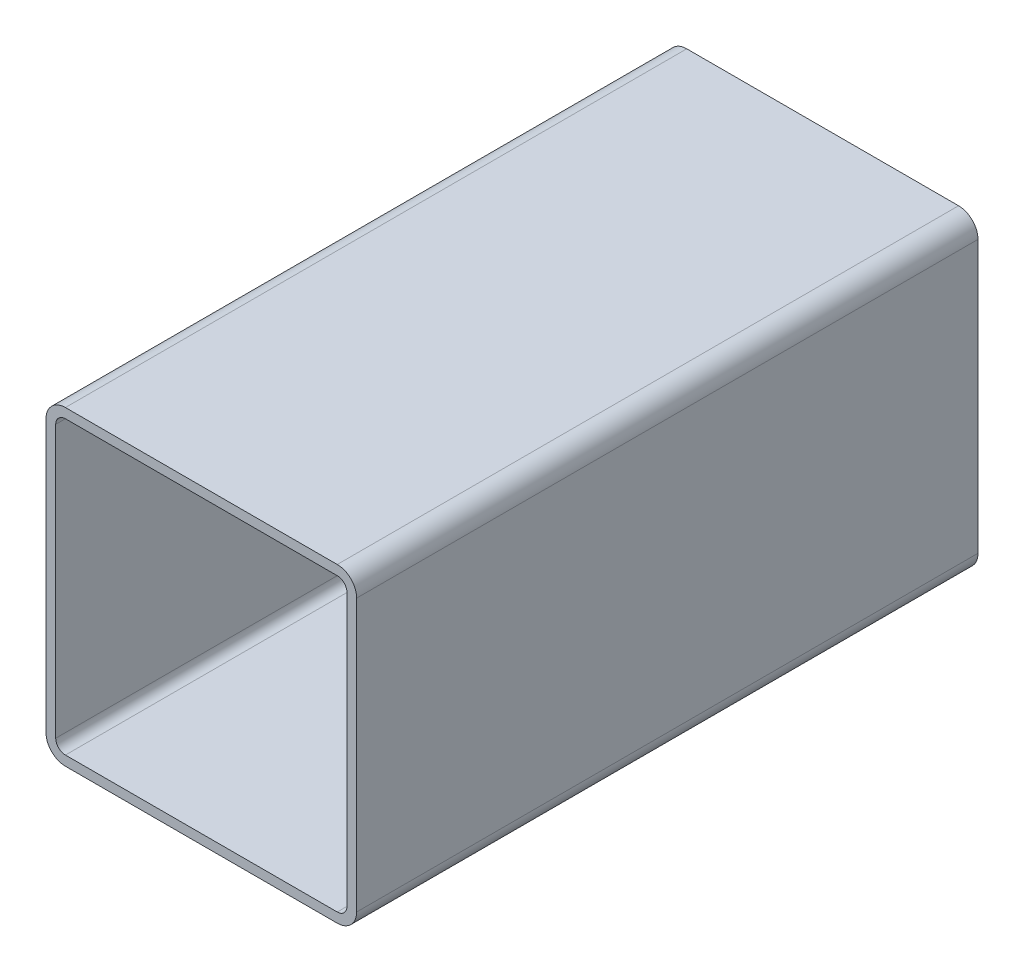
ISO-10303-21;
HEADER;
FILE_DESCRIPTION(('STEP AP214'),'2;1');
FILE_NAME('part.step','',(''),(''),'','','');
FILE_SCHEMA(('AUTOMOTIVE_DESIGN { 1 0 10303 214 1 1 1 1 }'));
ENDSEC;
DATA;
#1=APPLICATION_CONTEXT('core data for automotive mechanical design processes');
#2=APPLICATION_PROTOCOL_DEFINITION('international standard','automotive_design',2000,#1);
#3=PRODUCT_CONTEXT('',#1,'mechanical');
#4=PRODUCT('Part','Part','',(#3));
#5=PRODUCT_RELATED_PRODUCT_CATEGORY('part','',(#4));
#6=PRODUCT_DEFINITION_FORMATION('','',#4);
#7=PRODUCT_DEFINITION_CONTEXT('part definition',#1,'design');
#8=PRODUCT_DEFINITION('design','',#6,#7);
#9=PRODUCT_DEFINITION_SHAPE('','',#8);
#10=(LENGTH_UNIT() NAMED_UNIT(*) SI_UNIT(.MILLI.,.METRE.));
#11=(NAMED_UNIT(*) PLANE_ANGLE_UNIT() SI_UNIT($,.RADIAN.));
#12=(NAMED_UNIT(*) SI_UNIT($,.STERADIAN.) SOLID_ANGLE_UNIT());
#13=UNCERTAINTY_MEASURE_WITH_UNIT(LENGTH_MEASURE(1.E-05),#10,'distance_accuracy_value','');
#14=(GEOMETRIC_REPRESENTATION_CONTEXT(3) GLOBAL_UNCERTAINTY_ASSIGNED_CONTEXT((#13)) GLOBAL_UNIT_ASSIGNED_CONTEXT((#10,
#11,#12)) REPRESENTATION_CONTEXT('',''));
#15=CARTESIAN_POINT('',(0.,0.,0.));
#16=DIRECTION('',(0.,0.,1.));
#17=DIRECTION('',(1.,0.,0.));
#18=AXIS2_PLACEMENT_3D('',#15,#16,#17);
#19=CARTESIAN_POINT('',(9.57230139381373,144.886948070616,304.8));
#20=DIRECTION('',(0.,0.,1.));
#21=DIRECTION('',(1.,0.,0.));
#22=AXIS2_PLACEMENT_3D('',#19,#20,#21);
#23=PLANE('',#22);
#24=CARTESIAN_POINT('',(9.57230139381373,144.886948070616,304.8));
#25=DIRECTION('',(0.,0.,1.));
#26=DIRECTION('',(1.,0.,0.));
#27=AXIS2_PLACEMENT_3D('',#24,#25,#26);
#28=CIRCLE('',#27,9.52500000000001);
#29=CARTESIAN_POINT('',(9.57230139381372,154.411948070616,304.8));
#30=VERTEX_POINT('',#29);
#31=CARTESIAN_POINT('',(0.0473013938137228,144.886948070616,304.8));
#32=VERTEX_POINT('',#31);
#33=EDGE_CURVE('E211',#30,#32,#28,.T.);
#34=ORIENTED_EDGE('',*,*,#33,.T.);
#35=DIRECTION('',(0.,-1.,0.));
#36=VECTOR('',#35,1.);
#37=CARTESIAN_POINT('',(0.0473013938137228,11.5369480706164,304.8));
#38=LINE('',#37,#36);
#39=CARTESIAN_POINT('',(0.0473013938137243,11.5369480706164,304.8));
#40=VERTEX_POINT('',#39);
#41=EDGE_CURVE('E214',#32,#40,#38,.T.);
#42=ORIENTED_EDGE('',*,*,#41,.T.);
#43=CARTESIAN_POINT('',(9.57230139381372,11.5369480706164,304.8));
#44=DIRECTION('',(0.,0.,1.));
#45=DIRECTION('',(1.,0.,0.));
#46=AXIS2_PLACEMENT_3D('',#43,#44,#45);
#47=CIRCLE('',#46,9.525);
#48=CARTESIAN_POINT('',(9.57230139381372,2.01194807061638,304.8));
#49=VERTEX_POINT('',#48);
#50=EDGE_CURVE('E217',#40,#49,#47,.T.);
#51=ORIENTED_EDGE('',*,*,#50,.T.);
#52=DIRECTION('',(1.,0.,0.));
#53=VECTOR('',#52,1.);
#54=CARTESIAN_POINT('',(142.922301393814,2.01194807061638,304.8));
#55=LINE('',#54,#53);
#56=CARTESIAN_POINT('',(142.922301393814,2.01194807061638,304.8));
#57=VERTEX_POINT('',#56);
#58=EDGE_CURVE('E219',#49,#57,#55,.T.);
#59=ORIENTED_EDGE('',*,*,#58,.T.);
#60=CARTESIAN_POINT('',(142.922301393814,11.5369480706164,304.8));
#61=DIRECTION('',(0.,0.,1.));
#62=DIRECTION('',(1.,0.,0.));
#63=AXIS2_PLACEMENT_3D('',#60,#61,#62);
#64=CIRCLE('',#63,9.52500000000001);
#65=CARTESIAN_POINT('',(152.447301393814,11.5369480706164,304.8));
#66=VERTEX_POINT('',#65);
#67=EDGE_CURVE('E221',#57,#66,#64,.T.);
#68=ORIENTED_EDGE('',*,*,#67,.T.);
#69=DIRECTION('',(0.,1.,0.));
#70=VECTOR('',#69,1.);
#71=CARTESIAN_POINT('',(152.447301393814,144.886948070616,304.8));
#72=LINE('',#71,#70);
#73=CARTESIAN_POINT('',(152.447301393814,144.886948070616,304.8));
#74=VERTEX_POINT('',#73);
#75=EDGE_CURVE('E223',#66,#74,#72,.T.);
#76=ORIENTED_EDGE('',*,*,#75,.T.);
#77=CARTESIAN_POINT('',(142.922301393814,144.886948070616,304.8));
#78=DIRECTION('',(0.,0.,1.));
#79=DIRECTION('',(1.,0.,0.));
#80=AXIS2_PLACEMENT_3D('',#77,#78,#79);
#81=CIRCLE('',#80,9.52500000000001);
#82=CARTESIAN_POINT('',(142.922301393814,154.411948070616,304.8));
#83=VERTEX_POINT('',#82);
#84=EDGE_CURVE('E225',#74,#83,#81,.T.);
#85=ORIENTED_EDGE('',*,*,#84,.T.);
#86=DIRECTION('',(-1.,0.,0.));
#87=VECTOR('',#86,1.);
#88=CARTESIAN_POINT('',(9.57230139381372,154.411948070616,304.8));
#89=LINE('',#88,#87);
#90=EDGE_CURVE('E227',#83,#30,#89,.T.);
#91=ORIENTED_EDGE('',*,*,#90,.T.);
#92=EDGE_LOOP('',(#34,#42,#51,#59,#68,#76,#85,#91));
#93=FACE_BOUND('',#92,.T.);
#94=DIRECTION('',(0.,-1.,0.));
#95=VECTOR('',#94,1.);
#96=CARTESIAN_POINT('',(4.80980139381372,11.5369480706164,304.8));
#97=LINE('',#96,#95);
#98=CARTESIAN_POINT('',(4.80980139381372,144.886948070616,304.8));
#99=VERTEX_POINT('',#98);
#100=CARTESIAN_POINT('',(4.80980139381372,11.5369480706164,304.8));
#101=VERTEX_POINT('',#100);
#102=EDGE_CURVE('E154',#99,#101,#97,.T.);
#103=ORIENTED_EDGE('',*,*,#102,.F.);
#104=CARTESIAN_POINT('',(9.57230139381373,144.886948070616,304.8));
#105=DIRECTION('',(0.,0.,1.));
#106=DIRECTION('',(1.,0.,0.));
#107=AXIS2_PLACEMENT_3D('',#104,#105,#106);
#108=CIRCLE('',#107,4.7625);
#109=CARTESIAN_POINT('',(9.57230139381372,149.649448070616,304.8));
#110=VERTEX_POINT('',#109);
#111=EDGE_CURVE('E146',#110,#99,#108,.T.);
#112=ORIENTED_EDGE('',*,*,#111,.F.);
#113=DIRECTION('',(-1.,0.,0.));
#114=VECTOR('',#113,1.);
#115=CARTESIAN_POINT('',(9.57230139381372,149.649448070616,304.8));
#116=LINE('',#115,#114);
#117=CARTESIAN_POINT('',(142.922301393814,149.649448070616,304.8));
#118=VERTEX_POINT('',#117);
#119=EDGE_CURVE('E179',#118,#110,#116,.T.);
#120=ORIENTED_EDGE('',*,*,#119,.F.);
#121=CARTESIAN_POINT('',(142.922301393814,144.886948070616,304.8));
#122=DIRECTION('',(0.,0.,1.));
#123=DIRECTION('',(1.,0.,0.));
#124=AXIS2_PLACEMENT_3D('',#121,#122,#123);
#125=CIRCLE('',#124,4.7625);
#126=CARTESIAN_POINT('',(147.684801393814,144.886948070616,304.8));
#127=VERTEX_POINT('',#126);
#128=EDGE_CURVE('E177',#127,#118,#125,.T.);
#129=ORIENTED_EDGE('',*,*,#128,.F.);
#130=DIRECTION('',(0.,1.,0.));
#131=VECTOR('',#130,1.);
#132=CARTESIAN_POINT('',(147.684801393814,144.886948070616,304.8));
#133=LINE('',#132,#131);
#134=CARTESIAN_POINT('',(147.684801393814,11.5369480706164,304.8));
#135=VERTEX_POINT('',#134);
#136=EDGE_CURVE('E175',#135,#127,#133,.T.);
#137=ORIENTED_EDGE('',*,*,#136,.F.);
#138=CARTESIAN_POINT('',(142.922301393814,11.5369480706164,304.8));
#139=DIRECTION('',(0.,0.,1.));
#140=DIRECTION('',(1.,0.,0.));
#141=AXIS2_PLACEMENT_3D('',#138,#139,#140);
#142=CIRCLE('',#141,4.7625);
#143=CARTESIAN_POINT('',(142.922301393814,6.77444807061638,304.8));
#144=VERTEX_POINT('',#143);
#145=EDGE_CURVE('E173',#144,#135,#142,.T.);
#146=ORIENTED_EDGE('',*,*,#145,.F.);
#147=DIRECTION('',(1.,0.,0.));
#148=VECTOR('',#147,1.);
#149=CARTESIAN_POINT('',(142.922301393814,6.77444807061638,304.8));
#150=LINE('',#149,#148);
#151=CARTESIAN_POINT('',(9.57230139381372,6.77444807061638,304.8));
#152=VERTEX_POINT('',#151);
#153=EDGE_CURVE('E169',#152,#144,#150,.T.);
#154=ORIENTED_EDGE('',*,*,#153,.F.);
#155=CARTESIAN_POINT('',(9.57230139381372,11.5369480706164,304.8));
#156=DIRECTION('',(0.,0.,1.));
#157=DIRECTION('',(1.,0.,0.));
#158=AXIS2_PLACEMENT_3D('',#155,#156,#157);
#159=CIRCLE('',#158,4.7625);
#160=EDGE_CURVE('E167',#101,#152,#159,.T.);
#161=ORIENTED_EDGE('',*,*,#160,.F.);
#162=EDGE_LOOP('',(#103,#112,#120,#129,#137,#146,#154,#161));
#163=FACE_BOUND('',#162,.T.);
#164=ADVANCED_FACE('F33',(#93,#163),#23,.T.);
#165=CARTESIAN_POINT('',(9.57230139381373,144.886948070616,0.));
#166=DIRECTION('',(0.,0.,1.));
#167=DIRECTION('',(1.,0.,0.));
#168=AXIS2_PLACEMENT_3D('',#165,#166,#167);
#169=PLANE('',#168);
#170=CARTESIAN_POINT('',(9.57230139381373,144.886948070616,0.));
#171=DIRECTION('',(0.,0.,1.));
#172=DIRECTION('',(1.,0.,0.));
#173=AXIS2_PLACEMENT_3D('',#170,#171,#172);
#174=CIRCLE('',#173,9.52500000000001);
#175=CARTESIAN_POINT('',(9.57230139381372,154.411948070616,0.));
#176=VERTEX_POINT('',#175);
#177=CARTESIAN_POINT('',(0.0473013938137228,144.886948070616,0.));
#178=VERTEX_POINT('',#177);
#179=EDGE_CURVE('E162',#176,#178,#174,.T.);
#180=ORIENTED_EDGE('',*,*,#179,.F.);
#181=DIRECTION('',(-1.,0.,0.));
#182=VECTOR('',#181,1.);
#183=CARTESIAN_POINT('',(9.57230139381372,154.411948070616,0.));
#184=LINE('',#183,#182);
#185=CARTESIAN_POINT('',(142.922301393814,154.411948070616,0.));
#186=VERTEX_POINT('',#185);
#187=EDGE_CURVE('E215',#186,#176,#184,.T.);
#188=ORIENTED_EDGE('',*,*,#187,.F.);
#189=CARTESIAN_POINT('',(142.922301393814,144.886948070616,0.));
#190=DIRECTION('',(0.,0.,1.));
#191=DIRECTION('',(1.,0.,0.));
#192=AXIS2_PLACEMENT_3D('',#189,#190,#191);
#193=CIRCLE('',#192,9.52500000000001);
#194=CARTESIAN_POINT('',(152.447301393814,144.886948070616,0.));
#195=VERTEX_POINT('',#194);
#196=EDGE_CURVE('E242',#195,#186,#193,.T.);
#197=ORIENTED_EDGE('',*,*,#196,.F.);
#198=DIRECTION('',(0.,1.,0.));
#199=VECTOR('',#198,1.);
#200=CARTESIAN_POINT('',(152.447301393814,144.886948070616,0.));
#201=LINE('',#200,#199);
#202=CARTESIAN_POINT('',(152.447301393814,11.5369480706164,0.));
#203=VERTEX_POINT('',#202);
#204=EDGE_CURVE('E240',#203,#195,#201,.T.);
#205=ORIENTED_EDGE('',*,*,#204,.F.);
#206=CARTESIAN_POINT('',(142.922301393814,11.5369480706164,0.));
#207=DIRECTION('',(0.,0.,1.));
#208=DIRECTION('',(1.,0.,0.));
#209=AXIS2_PLACEMENT_3D('',#206,#207,#208);
#210=CIRCLE('',#209,9.52500000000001);
#211=CARTESIAN_POINT('',(142.922301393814,2.01194807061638,0.));
#212=VERTEX_POINT('',#211);
#213=EDGE_CURVE('E238',#212,#203,#210,.T.);
#214=ORIENTED_EDGE('',*,*,#213,.F.);
#215=DIRECTION('',(1.,0.,0.));
#216=VECTOR('',#215,1.);
#217=CARTESIAN_POINT('',(142.922301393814,2.01194807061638,0.));
#218=LINE('',#217,#216);
#219=CARTESIAN_POINT('',(9.57230139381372,2.01194807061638,0.));
#220=VERTEX_POINT('',#219);
#221=EDGE_CURVE('E236',#220,#212,#218,.T.);
#222=ORIENTED_EDGE('',*,*,#221,.F.);
#223=CARTESIAN_POINT('',(9.57230139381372,11.5369480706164,0.));
#224=DIRECTION('',(0.,0.,1.));
#225=DIRECTION('',(1.,0.,0.));
#226=AXIS2_PLACEMENT_3D('',#223,#224,#225);
#227=CIRCLE('',#226,9.525);
#228=CARTESIAN_POINT('',(0.0473013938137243,11.5369480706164,0.));
#229=VERTEX_POINT('',#228);
#230=EDGE_CURVE('E234',#229,#220,#227,.T.);
#231=ORIENTED_EDGE('',*,*,#230,.F.);
#232=DIRECTION('',(0.,-1.,0.));
#233=VECTOR('',#232,1.);
#234=CARTESIAN_POINT('',(0.0473013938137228,11.5369480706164,0.));
#235=LINE('',#234,#233);
#236=EDGE_CURVE('E232',#178,#229,#235,.T.);
#237=ORIENTED_EDGE('',*,*,#236,.F.);
#238=EDGE_LOOP('',(#180,#188,#197,#205,#214,#222,#231,#237));
#239=FACE_BOUND('',#238,.T.);
#240=CARTESIAN_POINT('',(9.57230139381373,144.886948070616,0.));
#241=DIRECTION('',(0.,0.,1.));
#242=DIRECTION('',(1.,0.,0.));
#243=AXIS2_PLACEMENT_3D('',#240,#241,#242);
#244=CIRCLE('',#243,4.7625);
#245=CARTESIAN_POINT('',(9.57230139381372,149.649448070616,0.));
#246=VERTEX_POINT('',#245);
#247=CARTESIAN_POINT('',(4.80980139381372,144.886948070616,0.));
#248=VERTEX_POINT('',#247);
#249=EDGE_CURVE('E56',#246,#248,#244,.T.);
#250=ORIENTED_EDGE('',*,*,#249,.T.);
#251=DIRECTION('',(0.,-1.,0.));
#252=VECTOR('',#251,1.);
#253=CARTESIAN_POINT('',(4.80980139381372,11.5369480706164,0.));
#254=LINE('',#253,#252);
#255=CARTESIAN_POINT('',(4.80980139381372,11.5369480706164,0.));
#256=VERTEX_POINT('',#255);
#257=EDGE_CURVE('E161',#248,#256,#254,.T.);
#258=ORIENTED_EDGE('',*,*,#257,.T.);
#259=CARTESIAN_POINT('',(9.57230139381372,11.5369480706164,0.));
#260=DIRECTION('',(0.,0.,1.));
#261=DIRECTION('',(1.,0.,0.));
#262=AXIS2_PLACEMENT_3D('',#259,#260,#261);
#263=CIRCLE('',#262,4.7625);
#264=CARTESIAN_POINT('',(9.57230139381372,6.77444807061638,0.));
#265=VERTEX_POINT('',#264);
#266=EDGE_CURVE('E183',#256,#265,#263,.T.);
#267=ORIENTED_EDGE('',*,*,#266,.T.);
#268=DIRECTION('',(1.,0.,0.));
#269=VECTOR('',#268,1.);
#270=CARTESIAN_POINT('',(142.922301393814,6.77444807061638,0.));
#271=LINE('',#270,#269);
#272=CARTESIAN_POINT('',(142.922301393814,6.77444807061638,0.));
#273=VERTEX_POINT('',#272);
#274=EDGE_CURVE('E186',#265,#273,#271,.T.);
#275=ORIENTED_EDGE('',*,*,#274,.T.);
#276=CARTESIAN_POINT('',(142.922301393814,11.5369480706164,0.));
#277=DIRECTION('',(0.,0.,1.));
#278=DIRECTION('',(1.,0.,0.));
#279=AXIS2_PLACEMENT_3D('',#276,#277,#278);
#280=CIRCLE('',#279,4.7625);
#281=CARTESIAN_POINT('',(147.684801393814,11.5369480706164,0.));
#282=VERTEX_POINT('',#281);
#283=EDGE_CURVE('E189',#273,#282,#280,.T.);
#284=ORIENTED_EDGE('',*,*,#283,.T.);
#285=DIRECTION('',(0.,1.,0.));
#286=VECTOR('',#285,1.);
#287=CARTESIAN_POINT('',(147.684801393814,144.886948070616,0.));
#288=LINE('',#287,#286);
#289=CARTESIAN_POINT('',(147.684801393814,144.886948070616,0.));
#290=VERTEX_POINT('',#289);
#291=EDGE_CURVE('E192',#282,#290,#288,.T.);
#292=ORIENTED_EDGE('',*,*,#291,.T.);
#293=CARTESIAN_POINT('',(142.922301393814,144.886948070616,0.));
#294=DIRECTION('',(0.,0.,1.));
#295=DIRECTION('',(1.,0.,0.));
#296=AXIS2_PLACEMENT_3D('',#293,#294,#295);
#297=CIRCLE('',#296,4.7625);
#298=CARTESIAN_POINT('',(142.922301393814,149.649448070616,0.));
#299=VERTEX_POINT('',#298);
#300=EDGE_CURVE('E195',#290,#299,#297,.T.);
#301=ORIENTED_EDGE('',*,*,#300,.T.);
#302=DIRECTION('',(-1.,0.,0.));
#303=VECTOR('',#302,1.);
#304=CARTESIAN_POINT('',(9.57230139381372,149.649448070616,0.));
#305=LINE('',#304,#303);
#306=EDGE_CURVE('E155',#299,#246,#305,.T.);
#307=ORIENTED_EDGE('',*,*,#306,.T.);
#308=EDGE_LOOP('',(#250,#258,#267,#275,#284,#292,#301,#307));
#309=FACE_BOUND('',#308,.T.);
#310=ADVANCED_FACE('F272',(#239,#309),#169,.F.);
#311=CARTESIAN_POINT('',(9.57230139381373,144.886948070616,304.8));
#312=DIRECTION('',(0.,0.,-1.));
#313=DIRECTION('',(-1.,0.,0.));
#314=AXIS2_PLACEMENT_3D('',#311,#312,#313);
#315=CYLINDRICAL_SURFACE('',#314,9.52500000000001);
#316=ORIENTED_EDGE('',*,*,#179,.T.);
#317=DIRECTION('',(0.,0.,-1.));
#318=VECTOR('',#317,1.);
#319=CARTESIAN_POINT('',(0.0473013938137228,144.886948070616,304.8));
#320=LINE('',#319,#318);
#321=EDGE_CURVE('E11',#32,#178,#320,.T.);
#322=ORIENTED_EDGE('',*,*,#321,.F.);
#323=ORIENTED_EDGE('',*,*,#33,.F.);
#324=DIRECTION('',(0.,0.,-1.));
#325=VECTOR('',#324,1.);
#326=CARTESIAN_POINT('',(9.57230139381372,154.411948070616,304.8));
#327=LINE('',#326,#325);
#328=EDGE_CURVE('E229',#30,#176,#327,.T.);
#329=ORIENTED_EDGE('',*,*,#328,.T.);
#330=EDGE_LOOP('',(#316,#322,#323,#329));
#331=FACE_BOUND('',#330,.T.);
#332=ADVANCED_FACE('F35',(#331),#315,.T.);
#333=CARTESIAN_POINT('',(0.0473013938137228,11.5369480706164,304.8));
#334=DIRECTION('',(1.,0.,0.));
#335=DIRECTION('',(0.,0.,-1.));
#336=AXIS2_PLACEMENT_3D('',#333,#334,#335);
#337=PLANE('',#336);
#338=ORIENTED_EDGE('',*,*,#236,.T.);
#339=DIRECTION('',(0.,0.,-1.));
#340=VECTOR('',#339,1.);
#341=CARTESIAN_POINT('',(0.0473013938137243,11.5369480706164,304.8));
#342=LINE('',#341,#340);
#343=EDGE_CURVE('E41',#40,#229,#342,.T.);
#344=ORIENTED_EDGE('',*,*,#343,.F.);
#345=ORIENTED_EDGE('',*,*,#41,.F.);
#346=ORIENTED_EDGE('',*,*,#321,.T.);
#347=EDGE_LOOP('',(#338,#344,#345,#346));
#348=FACE_BOUND('',#347,.T.);
#349=ADVANCED_FACE('F289',(#348),#337,.F.);
#350=CARTESIAN_POINT('',(9.57230139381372,11.5369480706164,304.8));
#351=DIRECTION('',(0.,0.,-1.));
#352=DIRECTION('',(-1.,0.,0.));
#353=AXIS2_PLACEMENT_3D('',#350,#351,#352);
#354=CYLINDRICAL_SURFACE('',#353,9.525);
#355=ORIENTED_EDGE('',*,*,#230,.T.);
#356=DIRECTION('',(0.,0.,-1.));
#357=VECTOR('',#356,1.);
#358=CARTESIAN_POINT('',(9.57230139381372,2.01194807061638,304.8));
#359=LINE('',#358,#357);
#360=EDGE_CURVE('E259',#49,#220,#359,.T.);
#361=ORIENTED_EDGE('',*,*,#360,.F.);
#362=ORIENTED_EDGE('',*,*,#50,.F.);
#363=ORIENTED_EDGE('',*,*,#343,.T.);
#364=EDGE_LOOP('',(#355,#361,#362,#363));
#365=FACE_BOUND('',#364,.T.);
#366=ADVANCED_FACE('F266',(#365),#354,.T.);
#367=CARTESIAN_POINT('',(142.922301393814,2.01194807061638,304.8));
#368=DIRECTION('',(0.,1.,0.));
#369=DIRECTION('',(0.,0.,1.));
#370=AXIS2_PLACEMENT_3D('',#367,#368,#369);
#371=PLANE('',#370);
#372=ORIENTED_EDGE('',*,*,#221,.T.);
#373=DIRECTION('',(0.,0.,-1.));
#374=VECTOR('',#373,1.);
#375=CARTESIAN_POINT('',(142.922301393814,2.01194807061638,304.8));
#376=LINE('',#375,#374);
#377=EDGE_CURVE('E256',#57,#212,#376,.T.);
#378=ORIENTED_EDGE('',*,*,#377,.F.);
#379=ORIENTED_EDGE('',*,*,#58,.F.);
#380=ORIENTED_EDGE('',*,*,#360,.T.);
#381=EDGE_LOOP('',(#372,#378,#379,#380));
#382=FACE_BOUND('',#381,.T.);
#383=ADVANCED_FACE('F278',(#382),#371,.F.);
#384=CARTESIAN_POINT('',(142.922301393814,11.5369480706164,304.8));
#385=DIRECTION('',(0.,0.,-1.));
#386=DIRECTION('',(-1.,0.,0.));
#387=AXIS2_PLACEMENT_3D('',#384,#385,#386);
#388=CYLINDRICAL_SURFACE('',#387,9.52500000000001);
#389=ORIENTED_EDGE('',*,*,#213,.T.);
#390=DIRECTION('',(0.,0.,-1.));
#391=VECTOR('',#390,1.);
#392=CARTESIAN_POINT('',(152.447301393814,11.5369480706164,304.8));
#393=LINE('',#392,#391);
#394=EDGE_CURVE('E253',#66,#203,#393,.T.);
#395=ORIENTED_EDGE('',*,*,#394,.F.);
#396=ORIENTED_EDGE('',*,*,#67,.F.);
#397=ORIENTED_EDGE('',*,*,#377,.T.);
#398=EDGE_LOOP('',(#389,#395,#396,#397));
#399=FACE_BOUND('',#398,.T.);
#400=ADVANCED_FACE('F282',(#399),#388,.T.);
#401=CARTESIAN_POINT('',(152.447301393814,144.886948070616,304.8));
#402=DIRECTION('',(-1.,0.,0.));
#403=DIRECTION('',(0.,0.,1.));
#404=AXIS2_PLACEMENT_3D('',#401,#402,#403);
#405=PLANE('',#404);
#406=ORIENTED_EDGE('',*,*,#204,.T.);
#407=DIRECTION('',(0.,0.,-1.));
#408=VECTOR('',#407,1.);
#409=CARTESIAN_POINT('',(152.447301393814,144.886948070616,304.8));
#410=LINE('',#409,#408);
#411=EDGE_CURVE('E250',#74,#195,#410,.T.);
#412=ORIENTED_EDGE('',*,*,#411,.F.);
#413=ORIENTED_EDGE('',*,*,#75,.F.);
#414=ORIENTED_EDGE('',*,*,#394,.T.);
#415=EDGE_LOOP('',(#406,#412,#413,#414));
#416=FACE_BOUND('',#415,.T.);
#417=ADVANCED_FACE('F302',(#416),#405,.F.);
#418=CARTESIAN_POINT('',(142.922301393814,144.886948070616,304.8));
#419=DIRECTION('',(0.,0.,-1.));
#420=DIRECTION('',(-1.,0.,0.));
#421=AXIS2_PLACEMENT_3D('',#418,#419,#420);
#422=CYLINDRICAL_SURFACE('',#421,9.52500000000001);
#423=ORIENTED_EDGE('',*,*,#196,.T.);
#424=DIRECTION('',(0.,0.,-1.));
#425=VECTOR('',#424,1.);
#426=CARTESIAN_POINT('',(142.922301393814,154.411948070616,304.8));
#427=LINE('',#426,#425);
#428=EDGE_CURVE('E247',#83,#186,#427,.T.);
#429=ORIENTED_EDGE('',*,*,#428,.F.);
#430=ORIENTED_EDGE('',*,*,#84,.F.);
#431=ORIENTED_EDGE('',*,*,#411,.T.);
#432=EDGE_LOOP('',(#423,#429,#430,#431));
#433=FACE_BOUND('',#432,.T.);
#434=ADVANCED_FACE('F300',(#433),#422,.T.);
#435=CARTESIAN_POINT('',(9.57230139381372,154.411948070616,304.8));
#436=DIRECTION('',(0.,-1.,0.));
#437=DIRECTION('',(0.,0.,-1.));
#438=AXIS2_PLACEMENT_3D('',#435,#436,#437);
#439=PLANE('',#438);
#440=ORIENTED_EDGE('',*,*,#187,.T.);
#441=ORIENTED_EDGE('',*,*,#328,.F.);
#442=ORIENTED_EDGE('',*,*,#90,.F.);
#443=ORIENTED_EDGE('',*,*,#428,.T.);
#444=EDGE_LOOP('',(#440,#441,#442,#443));
#445=FACE_BOUND('',#444,.T.);
#446=ADVANCED_FACE('F295',(#445),#439,.F.);
#447=CARTESIAN_POINT('',(9.57230139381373,144.886948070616,304.8));
#448=DIRECTION('',(0.,0.,-1.));
#449=DIRECTION('',(-1.,0.,0.));
#450=AXIS2_PLACEMENT_3D('',#447,#448,#449);
#451=CYLINDRICAL_SURFACE('',#450,4.7625);
#452=ORIENTED_EDGE('',*,*,#249,.F.);
#453=DIRECTION('',(0.,0.,-1.));
#454=VECTOR('',#453,1.);
#455=CARTESIAN_POINT('',(9.57230139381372,149.649448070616,304.8));
#456=LINE('',#455,#454);
#457=EDGE_CURVE('E150',#110,#246,#456,.T.);
#458=ORIENTED_EDGE('',*,*,#457,.F.);
#459=ORIENTED_EDGE('',*,*,#111,.T.);
#460=DIRECTION('',(0.,0.,-1.));
#461=VECTOR('',#460,1.);
#462=CARTESIAN_POINT('',(4.80980139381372,144.886948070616,304.8));
#463=LINE('',#462,#461);
#464=EDGE_CURVE('E149',#99,#248,#463,.T.);
#465=ORIENTED_EDGE('',*,*,#464,.T.);
#466=EDGE_LOOP('',(#452,#458,#459,#465));
#467=FACE_BOUND('',#466,.T.);
#468=ADVANCED_FACE('F148',(#467),#451,.F.);
#469=CARTESIAN_POINT('',(4.80980139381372,11.5369480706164,304.8));
#470=DIRECTION('',(1.,0.,0.));
#471=DIRECTION('',(0.,0.,-1.));
#472=AXIS2_PLACEMENT_3D('',#469,#470,#471);
#473=PLANE('',#472);
#474=ORIENTED_EDGE('',*,*,#257,.F.);
#475=ORIENTED_EDGE('',*,*,#464,.F.);
#476=ORIENTED_EDGE('',*,*,#102,.T.);
#477=DIRECTION('',(0.,0.,-1.));
#478=VECTOR('',#477,1.);
#479=CARTESIAN_POINT('',(4.80980139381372,11.5369480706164,304.8));
#480=LINE('',#479,#478);
#481=EDGE_CURVE('E163',#101,#256,#480,.T.);
#482=ORIENTED_EDGE('',*,*,#481,.T.);
#483=EDGE_LOOP('',(#474,#475,#476,#482));
#484=FACE_BOUND('',#483,.T.);
#485=ADVANCED_FACE('F158',(#484),#473,.T.);
#486=CARTESIAN_POINT('',(9.57230139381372,11.5369480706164,304.8));
#487=DIRECTION('',(0.,0.,-1.));
#488=DIRECTION('',(-1.,0.,0.));
#489=AXIS2_PLACEMENT_3D('',#486,#487,#488);
#490=CYLINDRICAL_SURFACE('',#489,4.7625);
#491=ORIENTED_EDGE('',*,*,#266,.F.);
#492=ORIENTED_EDGE('',*,*,#481,.F.);
#493=ORIENTED_EDGE('',*,*,#160,.T.);
#494=DIRECTION('',(0.,0.,-1.));
#495=VECTOR('',#494,1.);
#496=CARTESIAN_POINT('',(9.57230139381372,6.77444807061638,304.8));
#497=LINE('',#496,#495);
#498=EDGE_CURVE('E208',#152,#265,#497,.T.);
#499=ORIENTED_EDGE('',*,*,#498,.T.);
#500=EDGE_LOOP('',(#491,#492,#493,#499));
#501=FACE_BOUND('',#500,.T.);
#502=ADVANCED_FACE('F327',(#501),#490,.F.);
#503=CARTESIAN_POINT('',(142.922301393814,6.77444807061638,304.8));
#504=DIRECTION('',(0.,1.,0.));
#505=DIRECTION('',(0.,0.,1.));
#506=AXIS2_PLACEMENT_3D('',#503,#504,#505);
#507=PLANE('',#506);
#508=ORIENTED_EDGE('',*,*,#274,.F.);
#509=ORIENTED_EDGE('',*,*,#498,.F.);
#510=ORIENTED_EDGE('',*,*,#153,.T.);
#511=DIRECTION('',(0.,0.,-1.));
#512=VECTOR('',#511,1.);
#513=CARTESIAN_POINT('',(142.922301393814,6.77444807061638,304.8));
#514=LINE('',#513,#512);
#515=EDGE_CURVE('E206',#144,#273,#514,.T.);
#516=ORIENTED_EDGE('',*,*,#515,.T.);
#517=EDGE_LOOP('',(#508,#509,#510,#516));
#518=FACE_BOUND('',#517,.T.);
#519=ADVANCED_FACE('F331',(#518),#507,.T.);
#520=CARTESIAN_POINT('',(142.922301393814,11.5369480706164,304.8));
#521=DIRECTION('',(0.,0.,-1.));
#522=DIRECTION('',(-1.,0.,0.));
#523=AXIS2_PLACEMENT_3D('',#520,#521,#522);
#524=CYLINDRICAL_SURFACE('',#523,4.7625);
#525=ORIENTED_EDGE('',*,*,#283,.F.);
#526=ORIENTED_EDGE('',*,*,#515,.F.);
#527=ORIENTED_EDGE('',*,*,#145,.T.);
#528=DIRECTION('',(0.,0.,-1.));
#529=VECTOR('',#528,1.);
#530=CARTESIAN_POINT('',(147.684801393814,11.5369480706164,304.8));
#531=LINE('',#530,#529);
#532=EDGE_CURVE('E204',#135,#282,#531,.T.);
#533=ORIENTED_EDGE('',*,*,#532,.T.);
#534=EDGE_LOOP('',(#525,#526,#527,#533));
#535=FACE_BOUND('',#534,.T.);
#536=ADVANCED_FACE('F337',(#535),#524,.F.);
#537=CARTESIAN_POINT('',(147.684801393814,144.886948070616,304.8));
#538=DIRECTION('',(-1.,0.,0.));
#539=DIRECTION('',(0.,0.,1.));
#540=AXIS2_PLACEMENT_3D('',#537,#538,#539);
#541=PLANE('',#540);
#542=ORIENTED_EDGE('',*,*,#291,.F.);
#543=ORIENTED_EDGE('',*,*,#532,.F.);
#544=ORIENTED_EDGE('',*,*,#136,.T.);
#545=DIRECTION('',(0.,0.,-1.));
#546=VECTOR('',#545,1.);
#547=CARTESIAN_POINT('',(147.684801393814,144.886948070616,304.8));
#548=LINE('',#547,#546);
#549=EDGE_CURVE('E202',#127,#290,#548,.T.);
#550=ORIENTED_EDGE('',*,*,#549,.T.);
#551=EDGE_LOOP('',(#542,#543,#544,#550));
#552=FACE_BOUND('',#551,.T.);
#553=ADVANCED_FACE('F341',(#552),#541,.T.);
#554=CARTESIAN_POINT('',(142.922301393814,144.886948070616,304.8));
#555=DIRECTION('',(0.,0.,-1.));
#556=DIRECTION('',(-1.,0.,0.));
#557=AXIS2_PLACEMENT_3D('',#554,#555,#556);
#558=CYLINDRICAL_SURFACE('',#557,4.7625);
#559=ORIENTED_EDGE('',*,*,#300,.F.);
#560=ORIENTED_EDGE('',*,*,#549,.F.);
#561=ORIENTED_EDGE('',*,*,#128,.T.);
#562=DIRECTION('',(0.,0.,-1.));
#563=VECTOR('',#562,1.);
#564=CARTESIAN_POINT('',(142.922301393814,149.649448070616,304.8));
#565=LINE('',#564,#563);
#566=EDGE_CURVE('E48',#118,#299,#565,.T.);
#567=ORIENTED_EDGE('',*,*,#566,.T.);
#568=EDGE_LOOP('',(#559,#560,#561,#567));
#569=FACE_BOUND('',#568,.T.);
#570=ADVANCED_FACE('F345',(#569),#558,.F.);
#571=CARTESIAN_POINT('',(9.57230139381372,149.649448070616,304.8));
#572=DIRECTION('',(0.,-1.,0.));
#573=DIRECTION('',(0.,0.,-1.));
#574=AXIS2_PLACEMENT_3D('',#571,#572,#573);
#575=PLANE('',#574);
#576=ORIENTED_EDGE('',*,*,#306,.F.);
#577=ORIENTED_EDGE('',*,*,#566,.F.);
#578=ORIENTED_EDGE('',*,*,#119,.T.);
#579=ORIENTED_EDGE('',*,*,#457,.T.);
#580=EDGE_LOOP('',(#576,#577,#578,#579));
#581=FACE_BOUND('',#580,.T.);
#582=ADVANCED_FACE('F349',(#581),#575,.T.);
#583=CLOSED_SHELL('',(#164,#310,#332,#349,#366,#383,#400,#417,#434,#446,#468,#485,#502,#519,
#536,#553,#570,#582));
#584=MANIFOLD_SOLID_BREP('B2',#583);
#585=ADVANCED_BREP_SHAPE_REPRESENTATION('',(#18,#584),#14);
#586=SHAPE_DEFINITION_REPRESENTATION(#9,#585);
ENDSEC;
END-ISO-10303-21;
